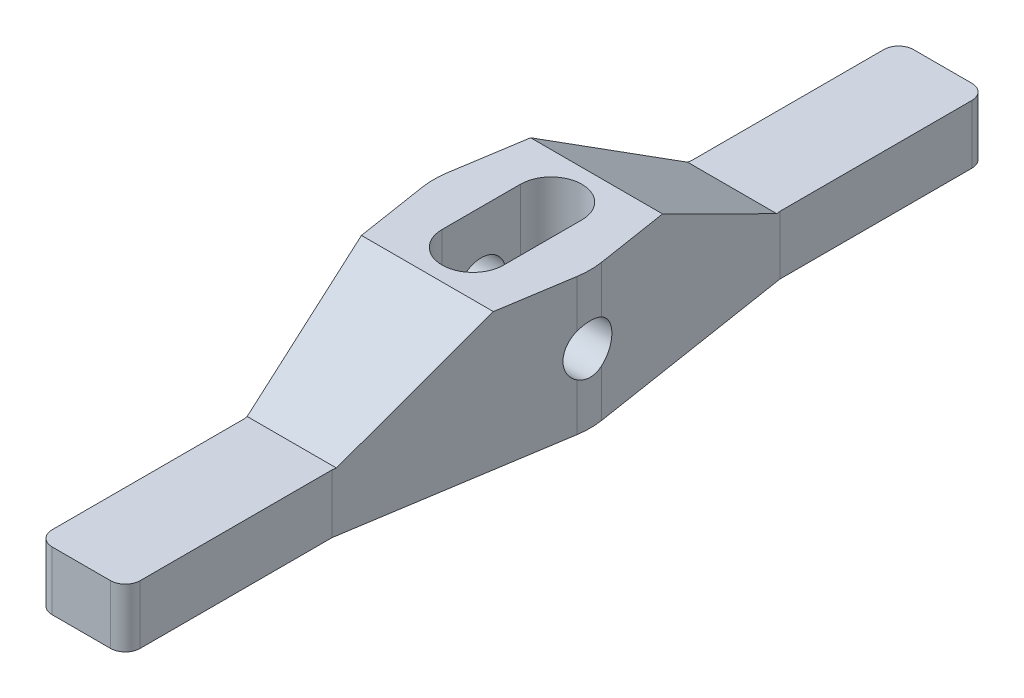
from build123d import *

# Parameters (mm, degrees)
EXTRUDE1_DEPTH          = 44.45
CUT_EXTRUDE1_DEPTH      = 149.785256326
CUT_EXTRUDE1_DEPTH_BACK = 149.785256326
CUT_EXTRUDE2_DEPTH      = 149.785256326
CUT_EXTRUDE2_DEPTH_BACK = 149.785256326
SKETCH3_R               = 7.93115
FILLET1_R               = 4.826


with BuildPart() as part:
    # Sketch1 → Extrude1 (new body)
    with BuildSketch(Plane(origin=(0, 0, 0), x_dir=(1, 0, 0), z_dir=(0, 1, 0))):
        with BuildLine():
            Line((-14.2875, 139.7), (14.2875, 139.7))
            Line((14.2875, 139.7), (14.2875, 72.6186))
            Line((14.2875, 72.6186), (25.091366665, 3.947571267))
            ThreePointArc((25.091366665, 3.947571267), (25.4, 0), (25.091366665, -3.947571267))
            Line((25.091366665, -3.947571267), (14.2875, -72.6186))
            Line((14.2875, -72.6186), (14.2875, -139.7))
            Line((14.2875, -139.7), (-14.2875, -139.7))
            Line((-14.2875, -139.7), (-14.2875, -72.6186))
            Line((-14.2875, -72.6186), (-25.091366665, -3.947571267))
            ThreePointArc((-25.091366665, -3.947571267), (-25.4, 0), (-25.091366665, 3.947571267))
            Line((-25.091366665, 3.947571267), (-14.2875, 72.6186))
            Line((-14.2875, 72.6186), (-14.2875, 139.7))
        make_face()
        with BuildLine():
            Line((-9.9949, 12.7), (-9.9949, -12.7))
            ThreePointArc((-9.9949, -12.7), (0, -22.6949), (9.9949, -12.7))
            Line((9.9949, -12.7), (9.9949, 12.7))
            ThreePointArc((9.9949, 12.7), (0, 22.6949), (-9.9949, 12.7))
        make_face(mode=Mode.SUBTRACT)
    extrude(amount=EXTRUDE1_DEPTH)

    # Sketch2 → Cut-Extrude1 (cut, two sides: drawn at the far end of the back side and taken through both)
    with BuildSketch(Plane(origin=(0, 0, 0), x_dir=(0, 0, -1), z_dir=(1, 0, 0)).offset(-CUT_EXTRUDE1_DEPTH_BACK)):
        Polygon((139.7, 44.45), (27.432, 44.45), (71.426090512, 19.05), (139.7, 19.05), align=None)
        Polygon((-139.7, 19.05), (-139.7, 44.45), (-27.432, 44.45), (-71.426090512, 19.05), align=None)
    extrude(amount=CUT_EXTRUDE1_DEPTH + CUT_EXTRUDE1_DEPTH_BACK, mode=Mode.SUBTRACT)

    # Sketch3 → Cut-Extrude2 (cut, two sides: drawn at the far end of the back side and taken through both)
    with BuildSketch(Plane(origin=(0, 0, 0), x_dir=(0, 0, -1), z_dir=(1, 0, 0)).offset(-CUT_EXTRUDE2_DEPTH_BACK)):
        with Locations(Location((0, 22.225, 0), (0, 0, 60.150068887))):
            Circle(SKETCH3_R)
    extrude(amount=CUT_EXTRUDE2_DEPTH + CUT_EXTRUDE2_DEPTH_BACK, mode=Mode.SUBTRACT)

    # Fillet1
    fillet1_edges = [part.edges().sort_by_distance(p)[0] for p in [
        (-14.2875, 9.525, -139.7),
        (14.2875, 9.525, -139.7),
        (14.2875, 9.525, 139.7),
        (-14.2875, 9.525, 139.7),
    ]]
    fillet(fillet1_edges, radius=FILLET1_R)


solid = part.part
